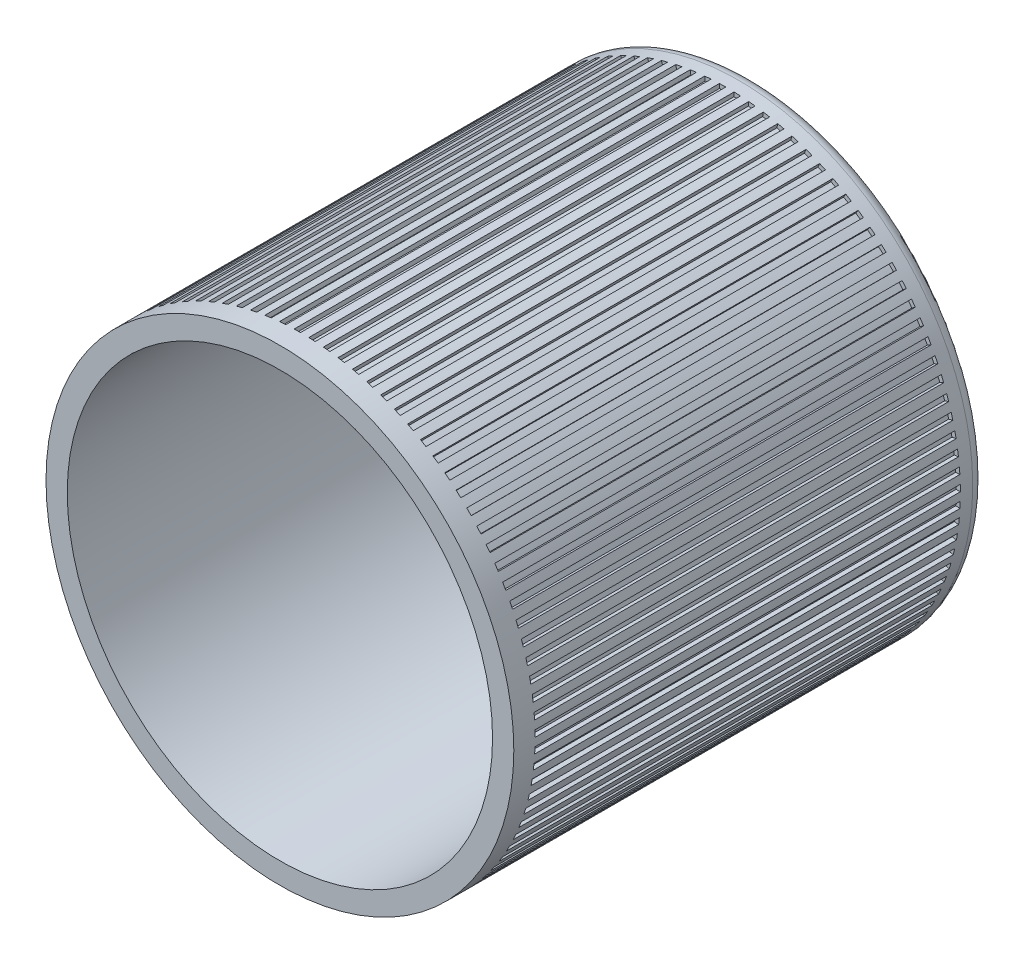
from build123d import *

# Parameters (mm, degrees)
FILLET1_R         = 0.3
WRAP1_SECTION_W   = 0.1
WRAP1_SECTION_H   = 10
WRAP1_ANGLE       = 1.562612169
CIRPATTERN1_COUNT = 100


with BuildPart() as part:
    # Sketch1 → Revolve1 (revolve)
    with BuildSketch(Plane(origin=(0, 0, 0), x_dir=(1, 0, 0), z_dir=(0, 1, 0))):
        with BuildLine():
            Line((5.5, 0), (5, 0))
            Line((5, 0), (5, 10.649649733))
            ThreePointArc((5, 10.649649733), (2.535897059, 11.285897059), (0, 11.5))
            Line((0, 11.5), (0, 12))
            ThreePointArc((0, 12), (2.795084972, 11.747967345), (5.5, 11))
            Line((5.5, 11), (5.5, 0))
        make_face()
    revolve(axis=Axis((0, 0, 0), (0, 0, -1)))

    # Fillet1
    fillet1_edges = [part.edges().sort_by_distance(p)[0] for p in [
        (-5.5, 0, -11),
    ]]
    fillet(fillet1_edges, radius=FILLET1_R)

    # Wrap1 section (on wrap section) → Wrap1 (revolve, cut)
    with BuildSketch(Plane(origin=(0, 0, -11), x_dir=(0.5853941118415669, 0.8107488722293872, 0), z_dir=(0.8107488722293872, -0.5853941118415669, 0))):
        with Locations((5.45, 5.5)):
            Rectangle(WRAP1_SECTION_W, WRAP1_SECTION_H)
    wrap1 = revolve(axis=Axis((0, 0, -11), (0, 0, 1)), revolution_arc=WRAP1_ANGLE, mode=Mode.SUBTRACT)

    # CirPattern1: Wrap1 ×100 about axis
    cirpattern1_axis = Axis((0, 0, 0), (0, 0, 1))
    for i in range(1, CIRPATTERN1_COUNT):
        add(wrap1.rotate(cirpattern1_axis, i * 360 / CIRPATTERN1_COUNT), mode=Mode.SUBTRACT)


solid = part.part
